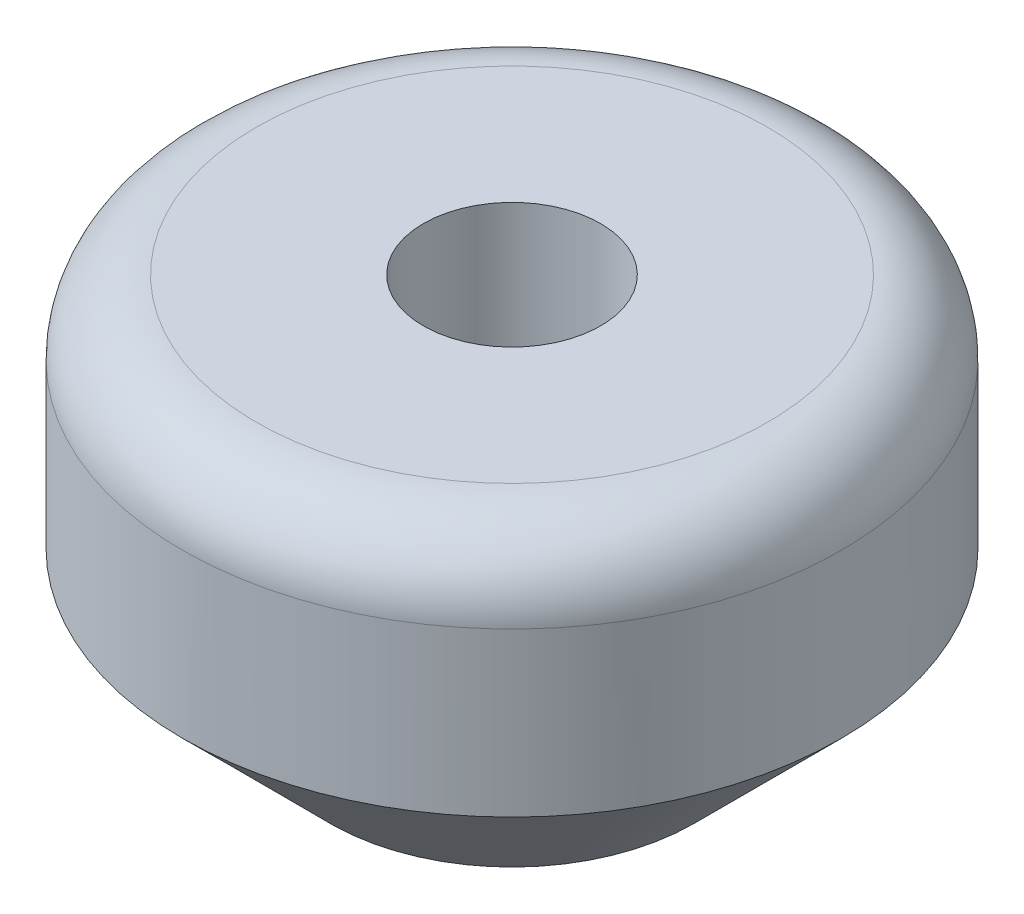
from build123d import *

# Parameters (mm, degrees)
CHANFREIN1_SIZE = 20
CONG_1_R        = 10


with BuildPart() as part:
    # Esquisse1 → Base-R_volution (revolve)
    with BuildSketch(Plane.XY):
        Polygon((-8, -133.507535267), (-8, -120.300262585), (-12, -99.5), (-12, -81.463034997), (-44.603002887, -81.463034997), (-44.603002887, -133.507535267), align=None)
    revolve(axis=Axis((0, -83.162980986, 0), (0, -1, 0)))

    # Chanfrein1
    chanfrein1_edges = [part.edges().sort_by_distance(p)[0] for p in [
        (44.603002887, -133.507535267, 0),
    ]]
    chamfer(chanfrein1_edges, length=CHANFREIN1_SIZE)

    # Cong_1
    cong_1_edges = [part.edges().sort_by_distance(p)[0] for p in [
        (44.603002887, -81.463034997, 0),
    ]]
    fillet(cong_1_edges, radius=CONG_1_R)


solid = part.part
